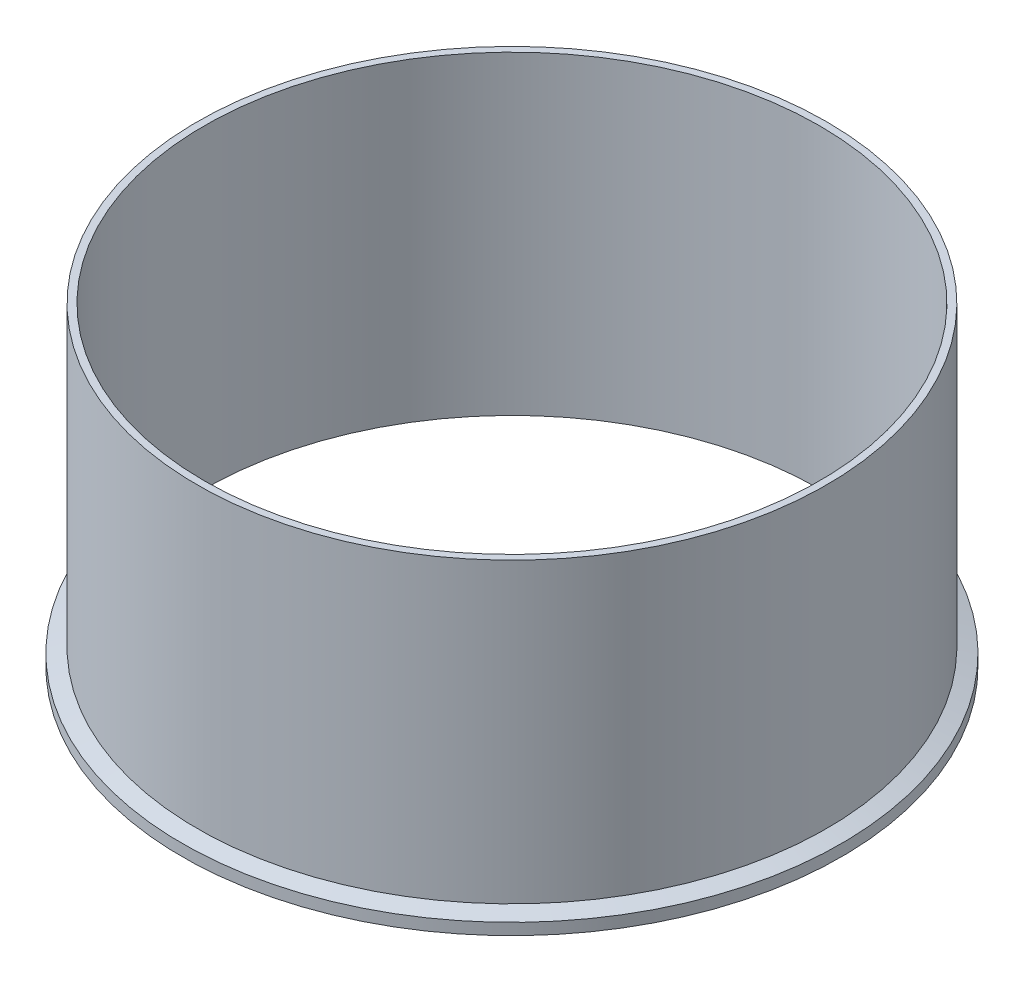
ISO-10303-21;
HEADER;
FILE_DESCRIPTION(('STEP AP214'),'2;1');
FILE_NAME('part.step','',(''),(''),'','','');
FILE_SCHEMA(('AUTOMOTIVE_DESIGN { 1 0 10303 214 1 1 1 1 }'));
ENDSEC;
DATA;
#1=APPLICATION_CONTEXT('core data for automotive mechanical design processes');
#2=APPLICATION_PROTOCOL_DEFINITION('international standard','automotive_design',2000,#1);
#3=PRODUCT_CONTEXT('',#1,'mechanical');
#4=PRODUCT('Part','Part','',(#3));
#5=PRODUCT_RELATED_PRODUCT_CATEGORY('part','',(#4));
#6=PRODUCT_DEFINITION_FORMATION('','',#4);
#7=PRODUCT_DEFINITION_CONTEXT('part definition',#1,'design');
#8=PRODUCT_DEFINITION('design','',#6,#7);
#9=PRODUCT_DEFINITION_SHAPE('','',#8);
#10=(LENGTH_UNIT() NAMED_UNIT(*) SI_UNIT(.MILLI.,.METRE.));
#11=(NAMED_UNIT(*) PLANE_ANGLE_UNIT() SI_UNIT($,.RADIAN.));
#12=(NAMED_UNIT(*) SI_UNIT($,.STERADIAN.) SOLID_ANGLE_UNIT());
#13=UNCERTAINTY_MEASURE_WITH_UNIT(LENGTH_MEASURE(1.E-05),#10,'distance_accuracy_value','');
#14=(GEOMETRIC_REPRESENTATION_CONTEXT(3) GLOBAL_UNCERTAINTY_ASSIGNED_CONTEXT((#13)) GLOBAL_UNIT_ASSIGNED_CONTEXT((#10,
#11,#12)) REPRESENTATION_CONTEXT('',''));
#15=CARTESIAN_POINT('',(0.,0.,0.));
#16=DIRECTION('',(0.,0.,1.));
#17=DIRECTION('',(1.,0.,0.));
#18=AXIS2_PLACEMENT_3D('',#15,#16,#17);
#19=CARTESIAN_POINT('',(0.,0.7874,0.));
#20=DIRECTION('',(0.,-1.,0.));
#21=DIRECTION('',(0.,0.,-1.));
#22=AXIS2_PLACEMENT_3D('',#19,#20,#21);
#23=TOROIDAL_SURFACE('',#22,156.199208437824,0.787400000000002);
#24=CARTESIAN_POINT('',(0.,0.,0.));
#25=DIRECTION('',(0.,-1.,0.));
#26=DIRECTION('',(0.,0.,-1.));
#27=AXIS2_PLACEMENT_3D('',#24,#25,#26);
#28=CIRCLE('',#27,156.199208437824);
#29=CARTESIAN_POINT('',(0.,0.,-156.199208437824));
#30=VERTEX_POINT('',#29);
#31=EDGE_CURVE('E67',#30,#30,#28,.T.);
#32=ORIENTED_EDGE('',*,*,#31,.T.);
#33=EDGE_LOOP('',(#32));
#34=FACE_BOUND('',#33,.T.);
#35=CARTESIAN_POINT('',(0.,0.474458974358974,0.));
#36=DIRECTION('',(0.,-1.,0.));
#37=DIRECTION('',(0.,0.,-1.));
#38=AXIS2_PLACEMENT_3D('',#35,#36,#37);
#39=CIRCLE('',#38,155.476666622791);
#40=CARTESIAN_POINT('',(0.,0.474458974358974,-155.476666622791));
#41=VERTEX_POINT('',#40);
#42=EDGE_CURVE('E10',#41,#41,#39,.T.);
#43=ORIENTED_EDGE('',*,*,#42,.F.);
#44=EDGE_LOOP('',(#43));
#45=FACE_BOUND('',#44,.T.);
#46=ADVANCED_FACE('F33',(#34,#45),#23,.T.);
#47=CARTESIAN_POINT('',(0.,0.,0.));
#48=DIRECTION('',(0.,-1.,0.));
#49=DIRECTION('',(0.,0.,-1.));
#50=AXIS2_PLACEMENT_3D('',#47,#48,#49);
#51=TOROIDAL_SURFACE('',#50,154.3812,1.1938);
#52=CARTESIAN_POINT('',(0.,0.474458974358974,0.));
#53=DIRECTION('',(0.,-1.,0.));
#54=DIRECTION('',(0.,0.,-1.));
#55=AXIS2_PLACEMENT_3D('',#52,#53,#54);
#56=CIRCLE('',#55,153.285733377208);
#57=CARTESIAN_POINT('',(0.,0.474458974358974,-153.285733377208));
#58=VERTEX_POINT('',#57);
#59=EDGE_CURVE('E39',#58,#58,#56,.T.);
#60=ORIENTED_EDGE('',*,*,#59,.F.);
#61=EDGE_LOOP('',(#60));
#62=FACE_BOUND('',#61,.T.);
#63=ORIENTED_EDGE('',*,*,#42,.T.);
#64=EDGE_LOOP('',(#63));
#65=FACE_BOUND('',#64,.T.);
#66=ADVANCED_FACE('F115',(#62,#65),#51,.F.);
#67=CARTESIAN_POINT('',(0.,0.7874,0.));
#68=DIRECTION('',(0.,-1.,0.));
#69=DIRECTION('',(0.,0.,-1.));
#70=AXIS2_PLACEMENT_3D('',#67,#68,#69);
#71=TOROIDAL_SURFACE('',#70,152.563191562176,0.787400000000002);
#72=ORIENTED_EDGE('',*,*,#59,.T.);
#73=EDGE_LOOP('',(#72));
#74=FACE_BOUND('',#73,.T.);
#75=CARTESIAN_POINT('',(0.,0.,0.));
#76=DIRECTION('',(0.,-1.,0.));
#77=DIRECTION('',(0.,0.,-1.));
#78=AXIS2_PLACEMENT_3D('',#75,#76,#77);
#79=CIRCLE('',#78,152.563191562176);
#80=CARTESIAN_POINT('',(0.,0.,-152.563191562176));
#81=VERTEX_POINT('',#80);
#82=EDGE_CURVE('E43',#81,#81,#79,.T.);
#83=ORIENTED_EDGE('',*,*,#82,.F.);
#84=EDGE_LOOP('',(#83));
#85=FACE_BOUND('',#84,.T.);
#86=ADVANCED_FACE('F111',(#74,#85),#71,.T.);
#87=CARTESIAN_POINT('',(0.,0.,0.));
#88=DIRECTION('',(0.,1.,0.));
#89=DIRECTION('',(0.,0.,1.));
#90=AXIS2_PLACEMENT_3D('',#87,#88,#89);
#91=PLANE('',#90);
#92=CARTESIAN_POINT('',(0.,0.,0.));
#93=DIRECTION('',(0.,-1.,0.));
#94=DIRECTION('',(0.,0.,-1.));
#95=AXIS2_PLACEMENT_3D('',#92,#93,#94);
#96=CIRCLE('',#95,148.9964);
#97=CARTESIAN_POINT('',(0.,0.,-148.9964));
#98=VERTEX_POINT('',#97);
#99=EDGE_CURVE('E47',#98,#98,#96,.T.);
#100=ORIENTED_EDGE('',*,*,#99,.F.);
#101=EDGE_LOOP('',(#100));
#102=FACE_BOUND('',#101,.T.);
#103=ORIENTED_EDGE('',*,*,#82,.T.);
#104=EDGE_LOOP('',(#103));
#105=FACE_BOUND('',#104,.T.);
#106=ADVANCED_FACE('F105',(#102,#105),#91,.F.);
#107=CARTESIAN_POINT('',(0.,0.,0.));
#108=DIRECTION('',(0.,-1.,0.));
#109=DIRECTION('',(0.,0.,-1.));
#110=AXIS2_PLACEMENT_3D('',#107,#108,#109);
#111=CYLINDRICAL_SURFACE('',#110,148.9964);
#112=ORIENTED_EDGE('',*,*,#99,.T.);
#113=EDGE_LOOP('',(#112));
#114=FACE_BOUND('',#113,.T.);
#115=CARTESIAN_POINT('',(0.,152.4,0.));
#116=DIRECTION('',(0.,-1.,0.));
#117=DIRECTION('',(0.,0.,-1.));
#118=AXIS2_PLACEMENT_3D('',#115,#116,#117);
#119=CIRCLE('',#118,148.9964);
#120=CARTESIAN_POINT('',(0.,152.4,-148.9964));
#121=VERTEX_POINT('',#120);
#122=EDGE_CURVE('E52',#121,#121,#119,.T.);
#123=ORIENTED_EDGE('',*,*,#122,.F.);
#124=EDGE_LOOP('',(#123));
#125=FACE_BOUND('',#124,.T.);
#126=ADVANCED_FACE('F100',(#114,#125),#111,.F.);
#127=CARTESIAN_POINT('',(0.,152.4,0.));
#128=DIRECTION('',(0.,-1.,0.));
#129=DIRECTION('',(0.,0.,-1.));
#130=AXIS2_PLACEMENT_3D('',#127,#128,#129);
#131=PLANE('',#130);
#132=CARTESIAN_POINT('',(0.,152.4,0.));
#133=DIRECTION('',(0.,-1.,0.));
#134=DIRECTION('',(0.,0.,-1.));
#135=AXIS2_PLACEMENT_3D('',#132,#133,#134);
#136=CIRCLE('',#135,152.4);
#137=CARTESIAN_POINT('',(0.,152.4,-152.4));
#138=VERTEX_POINT('',#137);
#139=EDGE_CURVE('E55',#138,#138,#136,.T.);
#140=ORIENTED_EDGE('',*,*,#139,.F.);
#141=EDGE_LOOP('',(#140));
#142=FACE_BOUND('',#141,.T.);
#143=ORIENTED_EDGE('',*,*,#122,.T.);
#144=EDGE_LOOP('',(#143));
#145=FACE_BOUND('',#144,.T.);
#146=ADVANCED_FACE('F94',(#142,#145),#131,.F.);
#147=CARTESIAN_POINT('',(0.,0.,0.));
#148=DIRECTION('',(0.,-1.,0.));
#149=DIRECTION('',(0.,0.,-1.));
#150=AXIS2_PLACEMENT_3D('',#147,#148,#149);
#151=CYLINDRICAL_SURFACE('',#150,152.4);
#152=CARTESIAN_POINT('',(0.,8.22278052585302,0.));
#153=DIRECTION('',(0.,-1.,0.));
#154=DIRECTION('',(0.,0.,-1.));
#155=AXIS2_PLACEMENT_3D('',#152,#153,#154);
#156=CIRCLE('',#155,152.4);
#157=CARTESIAN_POINT('',(0.,8.22278052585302,-152.4));
#158=VERTEX_POINT('',#157);
#159=EDGE_CURVE('E58',#158,#158,#156,.T.);
#160=ORIENTED_EDGE('',*,*,#159,.F.);
#161=EDGE_LOOP('',(#160));
#162=FACE_BOUND('',#161,.T.);
#163=ORIENTED_EDGE('',*,*,#139,.T.);
#164=EDGE_LOOP('',(#163));
#165=FACE_BOUND('',#164,.T.);
#166=ADVANCED_FACE('F88',(#162,#165),#151,.T.);
#167=CARTESIAN_POINT('',(0.,8.22278052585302,0.));
#168=DIRECTION('',(0.,-1.,0.));
#169=DIRECTION('',(0.,0.,-1.));
#170=AXIS2_PLACEMENT_3D('',#167,#168,#169);
#171=CONICAL_SURFACE('',#170,152.4,1.22173047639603);
#172=CARTESIAN_POINT('',(0.,5.58799999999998,0.));
#173=DIRECTION('',(0.,-1.,0.));
#174=DIRECTION('',(0.,0.,-1.));
#175=AXIS2_PLACEMENT_3D('',#172,#173,#174);
#176=CIRCLE('',#175,159.639);
#177=CARTESIAN_POINT('',(0.,5.58799999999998,-159.639));
#178=VERTEX_POINT('',#177);
#179=EDGE_CURVE('E61',#178,#178,#176,.T.);
#180=ORIENTED_EDGE('',*,*,#179,.F.);
#181=EDGE_LOOP('',(#180));
#182=FACE_BOUND('',#181,.T.);
#183=ORIENTED_EDGE('',*,*,#159,.T.);
#184=EDGE_LOOP('',(#183));
#185=FACE_BOUND('',#184,.T.);
#186=ADVANCED_FACE('F82',(#182,#185),#171,.T.);
#187=CARTESIAN_POINT('',(0.,0.,0.));
#188=DIRECTION('',(0.,-1.,0.));
#189=DIRECTION('',(0.,0.,-1.));
#190=AXIS2_PLACEMENT_3D('',#187,#188,#189);
#191=CYLINDRICAL_SURFACE('',#190,159.639);
#192=CARTESIAN_POINT('',(0.,0.,0.));
#193=DIRECTION('',(0.,-1.,0.));
#194=DIRECTION('',(0.,0.,-1.));
#195=AXIS2_PLACEMENT_3D('',#192,#193,#194);
#196=CIRCLE('',#195,159.639);
#197=CARTESIAN_POINT('',(0.,0.,-159.639));
#198=VERTEX_POINT('',#197);
#199=EDGE_CURVE('E64',#198,#198,#196,.T.);
#200=ORIENTED_EDGE('',*,*,#199,.F.);
#201=EDGE_LOOP('',(#200));
#202=FACE_BOUND('',#201,.T.);
#203=ORIENTED_EDGE('',*,*,#179,.T.);
#204=EDGE_LOOP('',(#203));
#205=FACE_BOUND('',#204,.T.);
#206=ADVANCED_FACE('F76',(#202,#205),#191,.T.);
#207=CARTESIAN_POINT('',(0.,0.,0.));
#208=DIRECTION('',(0.,1.,0.));
#209=DIRECTION('',(0.,0.,1.));
#210=AXIS2_PLACEMENT_3D('',#207,#208,#209);
#211=PLANE('',#210);
#212=ORIENTED_EDGE('',*,*,#31,.F.);
#213=EDGE_LOOP('',(#212));
#214=FACE_BOUND('',#213,.T.);
#215=ORIENTED_EDGE('',*,*,#199,.T.);
#216=EDGE_LOOP('',(#215));
#217=FACE_BOUND('',#216,.T.);
#218=ADVANCED_FACE('F73',(#214,#217),#211,.F.);
#219=CLOSED_SHELL('',(#46,#66,#86,#106,#126,#146,#166,#186,#206,#218));
#220=MANIFOLD_SOLID_BREP('B2',#219);
#221=ADVANCED_BREP_SHAPE_REPRESENTATION('',(#18,#220),#14);
#222=SHAPE_DEFINITION_REPRESENTATION(#9,#221);
ENDSEC;
END-ISO-10303-21;
